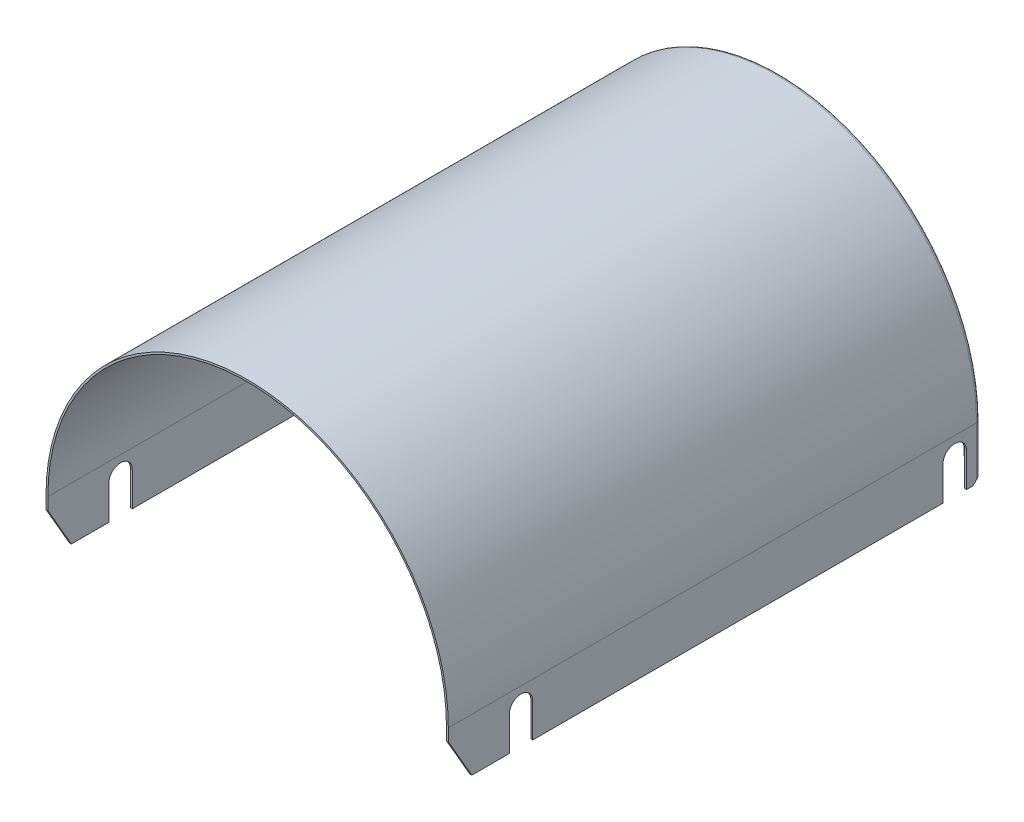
from build123d import *

# Parameters (mm, degrees)
EXTRU_MINCE1_DEPTH           = 226
ESQUISSE8_W                  = 0.8
ESQUISSE8_H                  = 226
EXTRUSION2_DEPTH             = 22.5
ENL_V_MAT_EXTRU_1_DEPTH      = 257.513703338
ENL_V_MAT_EXTRU_1_DEPTH_BACK = 257.513703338
ENL_V_MAT_EXTRU_3_DEPTH      = 257.513703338
ENL_V_MAT_EXTRU_3_DEPTH_BACK = 257.513703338
EXTRUSION1_START             = -0.8
EXTRUSION1_DEPTH             = 0.8
CONG_1_R                     = 1.5
CONG_2_R                     = 0.7
ENL_V_MAT_EXTRU_4_DEPTH      = 257.513703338
ENL_V_MAT_EXTRU_4_DEPTH_BACK = 257.513703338
ENL_V_MAT_EXTRU_5_DEPTH      = 258.218817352


with BuildPart() as part:
    # Esquisse1 → Extru.-Mince1 (new body)
    with BuildSketch(Plane.XY):
        with BuildLine():
            ThreePointArc((-85, 0), (0, 85), (85, 0))
            Line((85, 0), (85.8, 0))
            ThreePointArc((85.8, 0), (0, 85.8), (-85.8, 0))
            Line((-85.8, 0), (-85, 0))
        make_face()
    extrude(amount=EXTRU_MINCE1_DEPTH)

    # Esquisse8 → Extrusion2 (add)
    with BuildSketch(Plane.XZ):
        with Locations((85.4, 113)):
            Rectangle(ESQUISSE8_W, ESQUISSE8_H)
    extrusion2 = extrude(amount=EXTRUSION2_DEPTH)

    # Sym_trie1: Extrusion2 across plane
    add(extrusion2.mirror(Plane(origin=(0, 0, 0), x_dir=(0, 0, 1), z_dir=(1, 0, 0))))

    # Esquisse2 → Enl_v. mat.-Extru.1 (cut, two sides: drawn at the far end of the back side and taken through both)
    with BuildSketch(Plane(origin=(0, 0, 0), x_dir=(0, 0, -1), z_dir=(1, 0, 0)).offset(-ENL_V_MAT_EXTRU_1_DEPTH_BACK)):
        with BuildLine():
            Line((-200, -22.5), (-200, -8))
            ThreePointArc((-200, -8), (-195, -3), (-190, -8))
            Line((-190, -8), (-190, -22.5))
            Line((-190, -22.5), (-200, -22.5))
        make_face()
        with BuildLine():
            Line((-5, -22.5), (-5, -8))
            ThreePointArc((-5, -8), (-10, -3), (-15, -8))
            Line((-15, -8), (-15, -22.5))
            Line((-15, -22.5), (-5, -22.5))
        make_face()
    extrude(amount=ENL_V_MAT_EXTRU_1_DEPTH + ENL_V_MAT_EXTRU_1_DEPTH_BACK, mode=Mode.SUBTRACT)

    # Esquisse3 → Enl_v. mat.-Extru.3 (cut, two sides: drawn at the far end of the back side and taken through both)
    with BuildSketch(Plane(origin=(0, 0, 0), x_dir=(0, 0, -1), z_dir=(1, 0, 0)).offset(-ENL_V_MAT_EXTRU_3_DEPTH_BACK)):
        Polygon((-226, -5.179491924), (-226, -22.5), (-216, -22.5), align=None)
    extrude(amount=ENL_V_MAT_EXTRU_3_DEPTH + ENL_V_MAT_EXTRU_3_DEPTH_BACK, mode=Mode.SUBTRACT)

    # Esquisse5 → Extrusion1 (add)
    with BuildSketch(Plane.XY.offset(EXTRUSION1_START)):
        with BuildLine():
            Line((85.8, 0), (85.8, -22.5))
            Line((85.8, -22.5), (79.8, -22.5))
            Line((79.8, -22.5), (79.8, 0))
            ThreePointArc((79.8, 0), (0, 79.8), (-79.8, 0))
            Line((-79.8, 0), (-79.8, -22.5))
            Line((-79.8, -22.5), (-85.8, -22.5))
            Line((-85.8, -22.5), (-85.8, 0))
            ThreePointArc((-85.8, 0), (0, 85.8), (85.8, 0))
        make_face()
    extrude(amount=EXTRUSION1_DEPTH)

    # Cong_1
    cong_1_edges = [part.edges().sort_by_distance(p)[0] for p in [
        (0, 85.8, -0.8),
        (85.8, -11.25, -0.8),
        (-85.8, -11.25, -0.8),
    ]]
    fillet(cong_1_edges, radius=CONG_1_R)

    # Cong_2
    cong_2_edges = [part.edges().sort_by_distance(p)[0] for p in [
        (0, 85, 0),
        (-85, -11.25, 0),
        (85, -11.25, 0),
    ]]
    fillet(cong_2_edges, radius=CONG_2_R)

    # Esquisse6 → Enl_v. mat.-Extru.4 (cut, two sides: drawn at the far end of the back side and taken through both)
    with BuildSketch(Plane(origin=(0, 0, 0), x_dir=(0, 0, -1), z_dir=(1, 0, 0)).offset(-ENL_V_MAT_EXTRU_4_DEPTH_BACK)):
        Polygon((0.8, -22.5), (0.8, -19.5), (-2.2, -22.5), align=None)
    extrude(amount=ENL_V_MAT_EXTRU_4_DEPTH + ENL_V_MAT_EXTRU_4_DEPTH_BACK, mode=Mode.SUBTRACT)

    # Esquisse7 → Enl_v. mat.-Extru.5 (cut, through all)
    with BuildSketch(Plane(origin=(0, 0, -0.8), x_dir=(-1, 0, 0), z_dir=(0, 0, -1))):
        Polygon((-84.3, -20.3), (-79.8, -15.5), (-79.8, -22.5), (-84.3, -22.5), align=None)
    enl_v_mat_extru_5 = extrude(amount=-ENL_V_MAT_EXTRU_5_DEPTH, mode=Mode.SUBTRACT)

    # Sym_trie2: Enl_v. mat.-Extru.5 across plane
    add(enl_v_mat_extru_5.mirror(Plane(origin=(0, 0, 0), x_dir=(0, 0, 1), z_dir=(1, 0, 0))), mode=Mode.SUBTRACT)


solid = part.part
